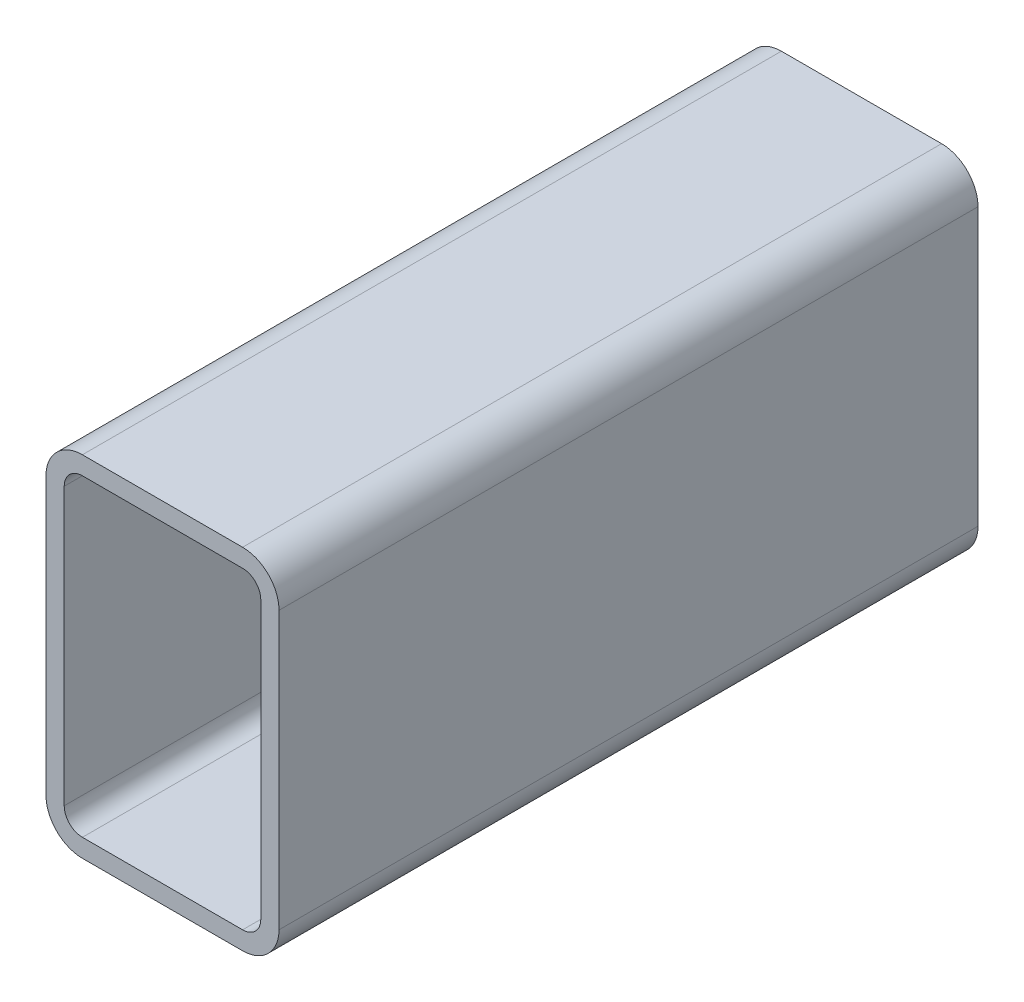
ISO-10303-21;
HEADER;
FILE_DESCRIPTION(('STEP AP214'),'2;1');
FILE_NAME('part.step','',(''),(''),'','','');
FILE_SCHEMA(('AUTOMOTIVE_DESIGN { 1 0 10303 214 1 1 1 1 }'));
ENDSEC;
DATA;
#1=APPLICATION_CONTEXT('core data for automotive mechanical design processes');
#2=APPLICATION_PROTOCOL_DEFINITION('international standard','automotive_design',2000,#1);
#3=PRODUCT_CONTEXT('',#1,'mechanical');
#4=PRODUCT('Part','Part','',(#3));
#5=PRODUCT_RELATED_PRODUCT_CATEGORY('part','',(#4));
#6=PRODUCT_DEFINITION_FORMATION('','',#4);
#7=PRODUCT_DEFINITION_CONTEXT('part definition',#1,'design');
#8=PRODUCT_DEFINITION('design','',#6,#7);
#9=PRODUCT_DEFINITION_SHAPE('','',#8);
#10=(LENGTH_UNIT() NAMED_UNIT(*) SI_UNIT(.MILLI.,.METRE.));
#11=(NAMED_UNIT(*) PLANE_ANGLE_UNIT() SI_UNIT($,.RADIAN.));
#12=(NAMED_UNIT(*) SI_UNIT($,.STERADIAN.) SOLID_ANGLE_UNIT());
#13=UNCERTAINTY_MEASURE_WITH_UNIT(LENGTH_MEASURE(1.E-05),#10,'distance_accuracy_value','');
#14=(GEOMETRIC_REPRESENTATION_CONTEXT(3) GLOBAL_UNCERTAINTY_ASSIGNED_CONTEXT((#13)) GLOBAL_UNIT_ASSIGNED_CONTEXT((#10,
#11,#12)) REPRESENTATION_CONTEXT('',''));
#15=CARTESIAN_POINT('',(0.,0.,0.));
#16=DIRECTION('',(0.,0.,1.));
#17=DIRECTION('',(1.,0.,0.));
#18=AXIS2_PLACEMENT_3D('',#15,#16,#17);
#19=CARTESIAN_POINT('',(17.5501778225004,138.536948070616,304.8));
#20=DIRECTION('',(0.,0.,1.));
#21=DIRECTION('',(1.,0.,0.));
#22=AXIS2_PLACEMENT_3D('',#19,#20,#21);
#23=PLANE('',#22);
#24=CARTESIAN_POINT('',(17.5501778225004,138.536948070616,304.8));
#25=DIRECTION('',(0.,0.,1.));
#26=DIRECTION('',(1.,0.,0.));
#27=AXIS2_PLACEMENT_3D('',#24,#25,#26);
#28=CIRCLE('',#27,15.875);
#29=CARTESIAN_POINT('',(17.5501778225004,154.411948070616,304.8));
#30=VERTEX_POINT('',#29);
#31=CARTESIAN_POINT('',(1.67517782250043,138.536948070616,304.8));
#32=VERTEX_POINT('',#31);
#33=EDGE_CURVE('E211',#30,#32,#28,.T.);
#34=ORIENTED_EDGE('',*,*,#33,.T.);
#35=DIRECTION('',(0.,-1.,0.));
#36=VECTOR('',#35,1.);
#37=CARTESIAN_POINT('',(1.67517782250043,17.8869480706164,304.8));
#38=LINE('',#37,#36);
#39=CARTESIAN_POINT('',(1.67517782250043,17.8869480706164,304.8));
#40=VERTEX_POINT('',#39);
#41=EDGE_CURVE('E214',#32,#40,#38,.T.);
#42=ORIENTED_EDGE('',*,*,#41,.T.);
#43=CARTESIAN_POINT('',(17.5501778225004,17.8869480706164,304.8));
#44=DIRECTION('',(0.,0.,1.));
#45=DIRECTION('',(1.,0.,0.));
#46=AXIS2_PLACEMENT_3D('',#43,#44,#45);
#47=CIRCLE('',#46,15.875);
#48=CARTESIAN_POINT('',(17.5501778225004,2.01194807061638,304.8));
#49=VERTEX_POINT('',#48);
#50=EDGE_CURVE('E217',#40,#49,#47,.T.);
#51=ORIENTED_EDGE('',*,*,#50,.T.);
#52=DIRECTION('',(1.,0.,0.));
#53=VECTOR('',#52,1.);
#54=CARTESIAN_POINT('',(87.4001778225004,2.01194807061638,304.8));
#55=LINE('',#54,#53);
#56=CARTESIAN_POINT('',(87.4001778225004,2.01194807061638,304.8));
#57=VERTEX_POINT('',#56);
#58=EDGE_CURVE('E219',#49,#57,#55,.T.);
#59=ORIENTED_EDGE('',*,*,#58,.T.);
#60=CARTESIAN_POINT('',(87.4001778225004,17.8869480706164,304.8));
#61=DIRECTION('',(0.,0.,1.));
#62=DIRECTION('',(1.,0.,0.));
#63=AXIS2_PLACEMENT_3D('',#60,#61,#62);
#64=CIRCLE('',#63,15.875);
#65=CARTESIAN_POINT('',(103.2751778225,17.8869480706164,304.8));
#66=VERTEX_POINT('',#65);
#67=EDGE_CURVE('E221',#57,#66,#64,.T.);
#68=ORIENTED_EDGE('',*,*,#67,.T.);
#69=DIRECTION('',(0.,1.,0.));
#70=VECTOR('',#69,1.);
#71=CARTESIAN_POINT('',(103.2751778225,138.536948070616,304.8));
#72=LINE('',#71,#70);
#73=CARTESIAN_POINT('',(103.2751778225,138.536948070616,304.8));
#74=VERTEX_POINT('',#73);
#75=EDGE_CURVE('E223',#66,#74,#72,.T.);
#76=ORIENTED_EDGE('',*,*,#75,.T.);
#77=CARTESIAN_POINT('',(87.4001778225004,138.536948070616,304.8));
#78=DIRECTION('',(0.,0.,1.));
#79=DIRECTION('',(1.,0.,0.));
#80=AXIS2_PLACEMENT_3D('',#77,#78,#79);
#81=CIRCLE('',#80,15.875);
#82=CARTESIAN_POINT('',(87.4001778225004,154.411948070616,304.8));
#83=VERTEX_POINT('',#82);
#84=EDGE_CURVE('E225',#74,#83,#81,.T.);
#85=ORIENTED_EDGE('',*,*,#84,.T.);
#86=DIRECTION('',(-1.,0.,0.));
#87=VECTOR('',#86,1.);
#88=CARTESIAN_POINT('',(17.5501778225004,154.411948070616,304.8));
#89=LINE('',#88,#87);
#90=EDGE_CURVE('E227',#83,#30,#89,.T.);
#91=ORIENTED_EDGE('',*,*,#90,.T.);
#92=EDGE_LOOP('',(#34,#42,#51,#59,#68,#76,#85,#91));
#93=FACE_BOUND('',#92,.T.);
#94=DIRECTION('',(0.,-1.,0.));
#95=VECTOR('',#94,1.);
#96=CARTESIAN_POINT('',(9.61267782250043,17.8869480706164,304.8));
#97=LINE('',#96,#95);
#98=CARTESIAN_POINT('',(9.61267782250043,138.536948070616,304.8));
#99=VERTEX_POINT('',#98);
#100=CARTESIAN_POINT('',(9.61267782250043,17.8869480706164,304.8));
#101=VERTEX_POINT('',#100);
#102=EDGE_CURVE('E154',#99,#101,#97,.T.);
#103=ORIENTED_EDGE('',*,*,#102,.F.);
#104=CARTESIAN_POINT('',(17.5501778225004,138.536948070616,304.8));
#105=DIRECTION('',(0.,0.,1.));
#106=DIRECTION('',(1.,0.,0.));
#107=AXIS2_PLACEMENT_3D('',#104,#105,#106);
#108=CIRCLE('',#107,7.93750000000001);
#109=CARTESIAN_POINT('',(17.5501778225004,146.474448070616,304.8));
#110=VERTEX_POINT('',#109);
#111=EDGE_CURVE('E146',#110,#99,#108,.T.);
#112=ORIENTED_EDGE('',*,*,#111,.F.);
#113=DIRECTION('',(-1.,0.,0.));
#114=VECTOR('',#113,1.);
#115=CARTESIAN_POINT('',(17.5501778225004,146.474448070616,304.8));
#116=LINE('',#115,#114);
#117=CARTESIAN_POINT('',(87.4001778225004,146.474448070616,304.8));
#118=VERTEX_POINT('',#117);
#119=EDGE_CURVE('E179',#118,#110,#116,.T.);
#120=ORIENTED_EDGE('',*,*,#119,.F.);
#121=CARTESIAN_POINT('',(87.4001778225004,138.536948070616,304.8));
#122=DIRECTION('',(0.,0.,1.));
#123=DIRECTION('',(1.,0.,0.));
#124=AXIS2_PLACEMENT_3D('',#121,#122,#123);
#125=CIRCLE('',#124,7.93750000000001);
#126=CARTESIAN_POINT('',(95.3376778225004,138.536948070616,304.8));
#127=VERTEX_POINT('',#126);
#128=EDGE_CURVE('E177',#127,#118,#125,.T.);
#129=ORIENTED_EDGE('',*,*,#128,.F.);
#130=DIRECTION('',(0.,1.,0.));
#131=VECTOR('',#130,1.);
#132=CARTESIAN_POINT('',(95.3376778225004,138.536948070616,304.8));
#133=LINE('',#132,#131);
#134=CARTESIAN_POINT('',(95.3376778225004,17.8869480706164,304.8));
#135=VERTEX_POINT('',#134);
#136=EDGE_CURVE('E175',#135,#127,#133,.T.);
#137=ORIENTED_EDGE('',*,*,#136,.F.);
#138=CARTESIAN_POINT('',(87.4001778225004,17.8869480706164,304.8));
#139=DIRECTION('',(0.,0.,1.));
#140=DIRECTION('',(1.,0.,0.));
#141=AXIS2_PLACEMENT_3D('',#138,#139,#140);
#142=CIRCLE('',#141,7.9375);
#143=CARTESIAN_POINT('',(87.4001778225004,9.94944807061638,304.8));
#144=VERTEX_POINT('',#143);
#145=EDGE_CURVE('E173',#144,#135,#142,.T.);
#146=ORIENTED_EDGE('',*,*,#145,.F.);
#147=DIRECTION('',(1.,0.,0.));
#148=VECTOR('',#147,1.);
#149=CARTESIAN_POINT('',(87.4001778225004,9.94944807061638,304.8));
#150=LINE('',#149,#148);
#151=CARTESIAN_POINT('',(17.5501778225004,9.94944807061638,304.8));
#152=VERTEX_POINT('',#151);
#153=EDGE_CURVE('E169',#152,#144,#150,.T.);
#154=ORIENTED_EDGE('',*,*,#153,.F.);
#155=CARTESIAN_POINT('',(17.5501778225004,17.8869480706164,304.8));
#156=DIRECTION('',(0.,0.,1.));
#157=DIRECTION('',(1.,0.,0.));
#158=AXIS2_PLACEMENT_3D('',#155,#156,#157);
#159=CIRCLE('',#158,7.9375);
#160=EDGE_CURVE('E167',#101,#152,#159,.T.);
#161=ORIENTED_EDGE('',*,*,#160,.F.);
#162=EDGE_LOOP('',(#103,#112,#120,#129,#137,#146,#154,#161));
#163=FACE_BOUND('',#162,.T.);
#164=ADVANCED_FACE('F33',(#93,#163),#23,.T.);
#165=CARTESIAN_POINT('',(17.5501778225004,138.536948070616,0.));
#166=DIRECTION('',(0.,0.,1.));
#167=DIRECTION('',(1.,0.,0.));
#168=AXIS2_PLACEMENT_3D('',#165,#166,#167);
#169=PLANE('',#168);
#170=CARTESIAN_POINT('',(17.5501778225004,138.536948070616,0.));
#171=DIRECTION('',(0.,0.,1.));
#172=DIRECTION('',(1.,0.,0.));
#173=AXIS2_PLACEMENT_3D('',#170,#171,#172);
#174=CIRCLE('',#173,15.875);
#175=CARTESIAN_POINT('',(17.5501778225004,154.411948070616,0.));
#176=VERTEX_POINT('',#175);
#177=CARTESIAN_POINT('',(1.67517782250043,138.536948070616,0.));
#178=VERTEX_POINT('',#177);
#179=EDGE_CURVE('E162',#176,#178,#174,.T.);
#180=ORIENTED_EDGE('',*,*,#179,.F.);
#181=DIRECTION('',(-1.,0.,0.));
#182=VECTOR('',#181,1.);
#183=CARTESIAN_POINT('',(17.5501778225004,154.411948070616,0.));
#184=LINE('',#183,#182);
#185=CARTESIAN_POINT('',(87.4001778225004,154.411948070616,0.));
#186=VERTEX_POINT('',#185);
#187=EDGE_CURVE('E215',#186,#176,#184,.T.);
#188=ORIENTED_EDGE('',*,*,#187,.F.);
#189=CARTESIAN_POINT('',(87.4001778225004,138.536948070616,0.));
#190=DIRECTION('',(0.,0.,1.));
#191=DIRECTION('',(1.,0.,0.));
#192=AXIS2_PLACEMENT_3D('',#189,#190,#191);
#193=CIRCLE('',#192,15.875);
#194=CARTESIAN_POINT('',(103.2751778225,138.536948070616,0.));
#195=VERTEX_POINT('',#194);
#196=EDGE_CURVE('E242',#195,#186,#193,.T.);
#197=ORIENTED_EDGE('',*,*,#196,.F.);
#198=DIRECTION('',(0.,1.,0.));
#199=VECTOR('',#198,1.);
#200=CARTESIAN_POINT('',(103.2751778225,138.536948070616,0.));
#201=LINE('',#200,#199);
#202=CARTESIAN_POINT('',(103.2751778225,17.8869480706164,0.));
#203=VERTEX_POINT('',#202);
#204=EDGE_CURVE('E240',#203,#195,#201,.T.);
#205=ORIENTED_EDGE('',*,*,#204,.F.);
#206=CARTESIAN_POINT('',(87.4001778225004,17.8869480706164,0.));
#207=DIRECTION('',(0.,0.,1.));
#208=DIRECTION('',(1.,0.,0.));
#209=AXIS2_PLACEMENT_3D('',#206,#207,#208);
#210=CIRCLE('',#209,15.875);
#211=CARTESIAN_POINT('',(87.4001778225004,2.01194807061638,0.));
#212=VERTEX_POINT('',#211);
#213=EDGE_CURVE('E238',#212,#203,#210,.T.);
#214=ORIENTED_EDGE('',*,*,#213,.F.);
#215=DIRECTION('',(1.,0.,0.));
#216=VECTOR('',#215,1.);
#217=CARTESIAN_POINT('',(87.4001778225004,2.01194807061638,0.));
#218=LINE('',#217,#216);
#219=CARTESIAN_POINT('',(17.5501778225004,2.01194807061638,0.));
#220=VERTEX_POINT('',#219);
#221=EDGE_CURVE('E236',#220,#212,#218,.T.);
#222=ORIENTED_EDGE('',*,*,#221,.F.);
#223=CARTESIAN_POINT('',(17.5501778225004,17.8869480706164,0.));
#224=DIRECTION('',(0.,0.,1.));
#225=DIRECTION('',(1.,0.,0.));
#226=AXIS2_PLACEMENT_3D('',#223,#224,#225);
#227=CIRCLE('',#226,15.875);
#228=CARTESIAN_POINT('',(1.67517782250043,17.8869480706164,0.));
#229=VERTEX_POINT('',#228);
#230=EDGE_CURVE('E234',#229,#220,#227,.T.);
#231=ORIENTED_EDGE('',*,*,#230,.F.);
#232=DIRECTION('',(0.,-1.,0.));
#233=VECTOR('',#232,1.);
#234=CARTESIAN_POINT('',(1.67517782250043,17.8869480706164,0.));
#235=LINE('',#234,#233);
#236=EDGE_CURVE('E232',#178,#229,#235,.T.);
#237=ORIENTED_EDGE('',*,*,#236,.F.);
#238=EDGE_LOOP('',(#180,#188,#197,#205,#214,#222,#231,#237));
#239=FACE_BOUND('',#238,.T.);
#240=CARTESIAN_POINT('',(17.5501778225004,138.536948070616,0.));
#241=DIRECTION('',(0.,0.,1.));
#242=DIRECTION('',(1.,0.,0.));
#243=AXIS2_PLACEMENT_3D('',#240,#241,#242);
#244=CIRCLE('',#243,7.93750000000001);
#245=CARTESIAN_POINT('',(17.5501778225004,146.474448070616,0.));
#246=VERTEX_POINT('',#245);
#247=CARTESIAN_POINT('',(9.61267782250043,138.536948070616,0.));
#248=VERTEX_POINT('',#247);
#249=EDGE_CURVE('E56',#246,#248,#244,.T.);
#250=ORIENTED_EDGE('',*,*,#249,.T.);
#251=DIRECTION('',(0.,-1.,0.));
#252=VECTOR('',#251,1.);
#253=CARTESIAN_POINT('',(9.61267782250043,17.8869480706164,0.));
#254=LINE('',#253,#252);
#255=CARTESIAN_POINT('',(9.61267782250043,17.8869480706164,0.));
#256=VERTEX_POINT('',#255);
#257=EDGE_CURVE('E161',#248,#256,#254,.T.);
#258=ORIENTED_EDGE('',*,*,#257,.T.);
#259=CARTESIAN_POINT('',(17.5501778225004,17.8869480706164,0.));
#260=DIRECTION('',(0.,0.,1.));
#261=DIRECTION('',(1.,0.,0.));
#262=AXIS2_PLACEMENT_3D('',#259,#260,#261);
#263=CIRCLE('',#262,7.9375);
#264=CARTESIAN_POINT('',(17.5501778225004,9.94944807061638,0.));
#265=VERTEX_POINT('',#264);
#266=EDGE_CURVE('E183',#256,#265,#263,.T.);
#267=ORIENTED_EDGE('',*,*,#266,.T.);
#268=DIRECTION('',(1.,0.,0.));
#269=VECTOR('',#268,1.);
#270=CARTESIAN_POINT('',(87.4001778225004,9.94944807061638,0.));
#271=LINE('',#270,#269);
#272=CARTESIAN_POINT('',(87.4001778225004,9.94944807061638,0.));
#273=VERTEX_POINT('',#272);
#274=EDGE_CURVE('E186',#265,#273,#271,.T.);
#275=ORIENTED_EDGE('',*,*,#274,.T.);
#276=CARTESIAN_POINT('',(87.4001778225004,17.8869480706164,0.));
#277=DIRECTION('',(0.,0.,1.));
#278=DIRECTION('',(1.,0.,0.));
#279=AXIS2_PLACEMENT_3D('',#276,#277,#278);
#280=CIRCLE('',#279,7.9375);
#281=CARTESIAN_POINT('',(95.3376778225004,17.8869480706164,0.));
#282=VERTEX_POINT('',#281);
#283=EDGE_CURVE('E189',#273,#282,#280,.T.);
#284=ORIENTED_EDGE('',*,*,#283,.T.);
#285=DIRECTION('',(0.,1.,0.));
#286=VECTOR('',#285,1.);
#287=CARTESIAN_POINT('',(95.3376778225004,138.536948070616,0.));
#288=LINE('',#287,#286);
#289=CARTESIAN_POINT('',(95.3376778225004,138.536948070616,0.));
#290=VERTEX_POINT('',#289);
#291=EDGE_CURVE('E192',#282,#290,#288,.T.);
#292=ORIENTED_EDGE('',*,*,#291,.T.);
#293=CARTESIAN_POINT('',(87.4001778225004,138.536948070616,0.));
#294=DIRECTION('',(0.,0.,1.));
#295=DIRECTION('',(1.,0.,0.));
#296=AXIS2_PLACEMENT_3D('',#293,#294,#295);
#297=CIRCLE('',#296,7.93750000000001);
#298=CARTESIAN_POINT('',(87.4001778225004,146.474448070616,0.));
#299=VERTEX_POINT('',#298);
#300=EDGE_CURVE('E195',#290,#299,#297,.T.);
#301=ORIENTED_EDGE('',*,*,#300,.T.);
#302=DIRECTION('',(-1.,0.,0.));
#303=VECTOR('',#302,1.);
#304=CARTESIAN_POINT('',(17.5501778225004,146.474448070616,0.));
#305=LINE('',#304,#303);
#306=EDGE_CURVE('E155',#299,#246,#305,.T.);
#307=ORIENTED_EDGE('',*,*,#306,.T.);
#308=EDGE_LOOP('',(#250,#258,#267,#275,#284,#292,#301,#307));
#309=FACE_BOUND('',#308,.T.);
#310=ADVANCED_FACE('F272',(#239,#309),#169,.F.);
#311=CARTESIAN_POINT('',(17.5501778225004,138.536948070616,304.8));
#312=DIRECTION('',(0.,0.,-1.));
#313=DIRECTION('',(-1.,0.,0.));
#314=AXIS2_PLACEMENT_3D('',#311,#312,#313);
#315=CYLINDRICAL_SURFACE('',#314,15.875);
#316=ORIENTED_EDGE('',*,*,#179,.T.);
#317=DIRECTION('',(0.,0.,-1.));
#318=VECTOR('',#317,1.);
#319=CARTESIAN_POINT('',(1.67517782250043,138.536948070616,304.8));
#320=LINE('',#319,#318);
#321=EDGE_CURVE('E11',#32,#178,#320,.T.);
#322=ORIENTED_EDGE('',*,*,#321,.F.);
#323=ORIENTED_EDGE('',*,*,#33,.F.);
#324=DIRECTION('',(0.,0.,-1.));
#325=VECTOR('',#324,1.);
#326=CARTESIAN_POINT('',(17.5501778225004,154.411948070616,304.8));
#327=LINE('',#326,#325);
#328=EDGE_CURVE('E229',#30,#176,#327,.T.);
#329=ORIENTED_EDGE('',*,*,#328,.T.);
#330=EDGE_LOOP('',(#316,#322,#323,#329));
#331=FACE_BOUND('',#330,.T.);
#332=ADVANCED_FACE('F35',(#331),#315,.T.);
#333=CARTESIAN_POINT('',(1.67517782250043,17.8869480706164,304.8));
#334=DIRECTION('',(1.,0.,0.));
#335=DIRECTION('',(0.,0.,-1.));
#336=AXIS2_PLACEMENT_3D('',#333,#334,#335);
#337=PLANE('',#336);
#338=ORIENTED_EDGE('',*,*,#236,.T.);
#339=DIRECTION('',(0.,0.,-1.));
#340=VECTOR('',#339,1.);
#341=CARTESIAN_POINT('',(1.67517782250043,17.8869480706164,304.8));
#342=LINE('',#341,#340);
#343=EDGE_CURVE('E41',#40,#229,#342,.T.);
#344=ORIENTED_EDGE('',*,*,#343,.F.);
#345=ORIENTED_EDGE('',*,*,#41,.F.);
#346=ORIENTED_EDGE('',*,*,#321,.T.);
#347=EDGE_LOOP('',(#338,#344,#345,#346));
#348=FACE_BOUND('',#347,.T.);
#349=ADVANCED_FACE('F289',(#348),#337,.F.);
#350=CARTESIAN_POINT('',(17.5501778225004,17.8869480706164,304.8));
#351=DIRECTION('',(0.,0.,-1.));
#352=DIRECTION('',(-1.,0.,0.));
#353=AXIS2_PLACEMENT_3D('',#350,#351,#352);
#354=CYLINDRICAL_SURFACE('',#353,15.875);
#355=ORIENTED_EDGE('',*,*,#230,.T.);
#356=DIRECTION('',(0.,0.,-1.));
#357=VECTOR('',#356,1.);
#358=CARTESIAN_POINT('',(17.5501778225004,2.01194807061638,304.8));
#359=LINE('',#358,#357);
#360=EDGE_CURVE('E259',#49,#220,#359,.T.);
#361=ORIENTED_EDGE('',*,*,#360,.F.);
#362=ORIENTED_EDGE('',*,*,#50,.F.);
#363=ORIENTED_EDGE('',*,*,#343,.T.);
#364=EDGE_LOOP('',(#355,#361,#362,#363));
#365=FACE_BOUND('',#364,.T.);
#366=ADVANCED_FACE('F266',(#365),#354,.T.);
#367=CARTESIAN_POINT('',(87.4001778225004,2.01194807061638,304.8));
#368=DIRECTION('',(0.,1.,0.));
#369=DIRECTION('',(0.,0.,1.));
#370=AXIS2_PLACEMENT_3D('',#367,#368,#369);
#371=PLANE('',#370);
#372=ORIENTED_EDGE('',*,*,#221,.T.);
#373=DIRECTION('',(0.,0.,-1.));
#374=VECTOR('',#373,1.);
#375=CARTESIAN_POINT('',(87.4001778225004,2.01194807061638,304.8));
#376=LINE('',#375,#374);
#377=EDGE_CURVE('E256',#57,#212,#376,.T.);
#378=ORIENTED_EDGE('',*,*,#377,.F.);
#379=ORIENTED_EDGE('',*,*,#58,.F.);
#380=ORIENTED_EDGE('',*,*,#360,.T.);
#381=EDGE_LOOP('',(#372,#378,#379,#380));
#382=FACE_BOUND('',#381,.T.);
#383=ADVANCED_FACE('F278',(#382),#371,.F.);
#384=CARTESIAN_POINT('',(87.4001778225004,17.8869480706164,304.8));
#385=DIRECTION('',(0.,0.,-1.));
#386=DIRECTION('',(-1.,0.,0.));
#387=AXIS2_PLACEMENT_3D('',#384,#385,#386);
#388=CYLINDRICAL_SURFACE('',#387,15.875);
#389=ORIENTED_EDGE('',*,*,#213,.T.);
#390=DIRECTION('',(0.,0.,-1.));
#391=VECTOR('',#390,1.);
#392=CARTESIAN_POINT('',(103.2751778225,17.8869480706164,304.8));
#393=LINE('',#392,#391);
#394=EDGE_CURVE('E253',#66,#203,#393,.T.);
#395=ORIENTED_EDGE('',*,*,#394,.F.);
#396=ORIENTED_EDGE('',*,*,#67,.F.);
#397=ORIENTED_EDGE('',*,*,#377,.T.);
#398=EDGE_LOOP('',(#389,#395,#396,#397));
#399=FACE_BOUND('',#398,.T.);
#400=ADVANCED_FACE('F282',(#399),#388,.T.);
#401=CARTESIAN_POINT('',(103.2751778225,138.536948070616,304.8));
#402=DIRECTION('',(-1.,0.,0.));
#403=DIRECTION('',(0.,0.,1.));
#404=AXIS2_PLACEMENT_3D('',#401,#402,#403);
#405=PLANE('',#404);
#406=ORIENTED_EDGE('',*,*,#204,.T.);
#407=DIRECTION('',(0.,0.,-1.));
#408=VECTOR('',#407,1.);
#409=CARTESIAN_POINT('',(103.2751778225,138.536948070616,304.8));
#410=LINE('',#409,#408);
#411=EDGE_CURVE('E250',#74,#195,#410,.T.);
#412=ORIENTED_EDGE('',*,*,#411,.F.);
#413=ORIENTED_EDGE('',*,*,#75,.F.);
#414=ORIENTED_EDGE('',*,*,#394,.T.);
#415=EDGE_LOOP('',(#406,#412,#413,#414));
#416=FACE_BOUND('',#415,.T.);
#417=ADVANCED_FACE('F302',(#416),#405,.F.);
#418=CARTESIAN_POINT('',(87.4001778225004,138.536948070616,304.8));
#419=DIRECTION('',(0.,0.,-1.));
#420=DIRECTION('',(-1.,0.,0.));
#421=AXIS2_PLACEMENT_3D('',#418,#419,#420);
#422=CYLINDRICAL_SURFACE('',#421,15.875);
#423=ORIENTED_EDGE('',*,*,#196,.T.);
#424=DIRECTION('',(0.,0.,-1.));
#425=VECTOR('',#424,1.);
#426=CARTESIAN_POINT('',(87.4001778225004,154.411948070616,304.8));
#427=LINE('',#426,#425);
#428=EDGE_CURVE('E247',#83,#186,#427,.T.);
#429=ORIENTED_EDGE('',*,*,#428,.F.);
#430=ORIENTED_EDGE('',*,*,#84,.F.);
#431=ORIENTED_EDGE('',*,*,#411,.T.);
#432=EDGE_LOOP('',(#423,#429,#430,#431));
#433=FACE_BOUND('',#432,.T.);
#434=ADVANCED_FACE('F300',(#433),#422,.T.);
#435=CARTESIAN_POINT('',(17.5501778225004,154.411948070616,304.8));
#436=DIRECTION('',(0.,-1.,0.));
#437=DIRECTION('',(0.,0.,-1.));
#438=AXIS2_PLACEMENT_3D('',#435,#436,#437);
#439=PLANE('',#438);
#440=ORIENTED_EDGE('',*,*,#187,.T.);
#441=ORIENTED_EDGE('',*,*,#328,.F.);
#442=ORIENTED_EDGE('',*,*,#90,.F.);
#443=ORIENTED_EDGE('',*,*,#428,.T.);
#444=EDGE_LOOP('',(#440,#441,#442,#443));
#445=FACE_BOUND('',#444,.T.);
#446=ADVANCED_FACE('F295',(#445),#439,.F.);
#447=CARTESIAN_POINT('',(17.5501778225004,138.536948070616,304.8));
#448=DIRECTION('',(0.,0.,-1.));
#449=DIRECTION('',(-1.,0.,0.));
#450=AXIS2_PLACEMENT_3D('',#447,#448,#449);
#451=CYLINDRICAL_SURFACE('',#450,7.93750000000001);
#452=ORIENTED_EDGE('',*,*,#249,.F.);
#453=DIRECTION('',(0.,0.,-1.));
#454=VECTOR('',#453,1.);
#455=CARTESIAN_POINT('',(17.5501778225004,146.474448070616,304.8));
#456=LINE('',#455,#454);
#457=EDGE_CURVE('E150',#110,#246,#456,.T.);
#458=ORIENTED_EDGE('',*,*,#457,.F.);
#459=ORIENTED_EDGE('',*,*,#111,.T.);
#460=DIRECTION('',(0.,0.,-1.));
#461=VECTOR('',#460,1.);
#462=CARTESIAN_POINT('',(9.61267782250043,138.536948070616,304.8));
#463=LINE('',#462,#461);
#464=EDGE_CURVE('E149',#99,#248,#463,.T.);
#465=ORIENTED_EDGE('',*,*,#464,.T.);
#466=EDGE_LOOP('',(#452,#458,#459,#465));
#467=FACE_BOUND('',#466,.T.);
#468=ADVANCED_FACE('F148',(#467),#451,.F.);
#469=CARTESIAN_POINT('',(9.61267782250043,17.8869480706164,304.8));
#470=DIRECTION('',(1.,0.,0.));
#471=DIRECTION('',(0.,0.,-1.));
#472=AXIS2_PLACEMENT_3D('',#469,#470,#471);
#473=PLANE('',#472);
#474=ORIENTED_EDGE('',*,*,#257,.F.);
#475=ORIENTED_EDGE('',*,*,#464,.F.);
#476=ORIENTED_EDGE('',*,*,#102,.T.);
#477=DIRECTION('',(0.,0.,-1.));
#478=VECTOR('',#477,1.);
#479=CARTESIAN_POINT('',(9.61267782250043,17.8869480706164,304.8));
#480=LINE('',#479,#478);
#481=EDGE_CURVE('E163',#101,#256,#480,.T.);
#482=ORIENTED_EDGE('',*,*,#481,.T.);
#483=EDGE_LOOP('',(#474,#475,#476,#482));
#484=FACE_BOUND('',#483,.T.);
#485=ADVANCED_FACE('F158',(#484),#473,.T.);
#486=CARTESIAN_POINT('',(17.5501778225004,17.8869480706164,304.8));
#487=DIRECTION('',(0.,0.,-1.));
#488=DIRECTION('',(-1.,0.,0.));
#489=AXIS2_PLACEMENT_3D('',#486,#487,#488);
#490=CYLINDRICAL_SURFACE('',#489,7.9375);
#491=ORIENTED_EDGE('',*,*,#266,.F.);
#492=ORIENTED_EDGE('',*,*,#481,.F.);
#493=ORIENTED_EDGE('',*,*,#160,.T.);
#494=DIRECTION('',(0.,0.,-1.));
#495=VECTOR('',#494,1.);
#496=CARTESIAN_POINT('',(17.5501778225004,9.94944807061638,304.8));
#497=LINE('',#496,#495);
#498=EDGE_CURVE('E208',#152,#265,#497,.T.);
#499=ORIENTED_EDGE('',*,*,#498,.T.);
#500=EDGE_LOOP('',(#491,#492,#493,#499));
#501=FACE_BOUND('',#500,.T.);
#502=ADVANCED_FACE('F327',(#501),#490,.F.);
#503=CARTESIAN_POINT('',(87.4001778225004,9.94944807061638,304.8));
#504=DIRECTION('',(0.,1.,0.));
#505=DIRECTION('',(0.,0.,1.));
#506=AXIS2_PLACEMENT_3D('',#503,#504,#505);
#507=PLANE('',#506);
#508=ORIENTED_EDGE('',*,*,#274,.F.);
#509=ORIENTED_EDGE('',*,*,#498,.F.);
#510=ORIENTED_EDGE('',*,*,#153,.T.);
#511=DIRECTION('',(0.,0.,-1.));
#512=VECTOR('',#511,1.);
#513=CARTESIAN_POINT('',(87.4001778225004,9.94944807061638,304.8));
#514=LINE('',#513,#512);
#515=EDGE_CURVE('E206',#144,#273,#514,.T.);
#516=ORIENTED_EDGE('',*,*,#515,.T.);
#517=EDGE_LOOP('',(#508,#509,#510,#516));
#518=FACE_BOUND('',#517,.T.);
#519=ADVANCED_FACE('F331',(#518),#507,.T.);
#520=CARTESIAN_POINT('',(87.4001778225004,17.8869480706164,304.8));
#521=DIRECTION('',(0.,0.,-1.));
#522=DIRECTION('',(-1.,0.,0.));
#523=AXIS2_PLACEMENT_3D('',#520,#521,#522);
#524=CYLINDRICAL_SURFACE('',#523,7.9375);
#525=ORIENTED_EDGE('',*,*,#283,.F.);
#526=ORIENTED_EDGE('',*,*,#515,.F.);
#527=ORIENTED_EDGE('',*,*,#145,.T.);
#528=DIRECTION('',(0.,0.,-1.));
#529=VECTOR('',#528,1.);
#530=CARTESIAN_POINT('',(95.3376778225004,17.8869480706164,304.8));
#531=LINE('',#530,#529);
#532=EDGE_CURVE('E204',#135,#282,#531,.T.);
#533=ORIENTED_EDGE('',*,*,#532,.T.);
#534=EDGE_LOOP('',(#525,#526,#527,#533));
#535=FACE_BOUND('',#534,.T.);
#536=ADVANCED_FACE('F337',(#535),#524,.F.);
#537=CARTESIAN_POINT('',(95.3376778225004,138.536948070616,304.8));
#538=DIRECTION('',(-1.,0.,0.));
#539=DIRECTION('',(0.,0.,1.));
#540=AXIS2_PLACEMENT_3D('',#537,#538,#539);
#541=PLANE('',#540);
#542=ORIENTED_EDGE('',*,*,#291,.F.);
#543=ORIENTED_EDGE('',*,*,#532,.F.);
#544=ORIENTED_EDGE('',*,*,#136,.T.);
#545=DIRECTION('',(0.,0.,-1.));
#546=VECTOR('',#545,1.);
#547=CARTESIAN_POINT('',(95.3376778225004,138.536948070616,304.8));
#548=LINE('',#547,#546);
#549=EDGE_CURVE('E202',#127,#290,#548,.T.);
#550=ORIENTED_EDGE('',*,*,#549,.T.);
#551=EDGE_LOOP('',(#542,#543,#544,#550));
#552=FACE_BOUND('',#551,.T.);
#553=ADVANCED_FACE('F341',(#552),#541,.T.);
#554=CARTESIAN_POINT('',(87.4001778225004,138.536948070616,304.8));
#555=DIRECTION('',(0.,0.,-1.));
#556=DIRECTION('',(-1.,0.,0.));
#557=AXIS2_PLACEMENT_3D('',#554,#555,#556);
#558=CYLINDRICAL_SURFACE('',#557,7.93750000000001);
#559=ORIENTED_EDGE('',*,*,#300,.F.);
#560=ORIENTED_EDGE('',*,*,#549,.F.);
#561=ORIENTED_EDGE('',*,*,#128,.T.);
#562=DIRECTION('',(0.,0.,-1.));
#563=VECTOR('',#562,1.);
#564=CARTESIAN_POINT('',(87.4001778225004,146.474448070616,304.8));
#565=LINE('',#564,#563);
#566=EDGE_CURVE('E48',#118,#299,#565,.T.);
#567=ORIENTED_EDGE('',*,*,#566,.T.);
#568=EDGE_LOOP('',(#559,#560,#561,#567));
#569=FACE_BOUND('',#568,.T.);
#570=ADVANCED_FACE('F345',(#569),#558,.F.);
#571=CARTESIAN_POINT('',(17.5501778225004,146.474448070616,304.8));
#572=DIRECTION('',(0.,-1.,0.));
#573=DIRECTION('',(0.,0.,-1.));
#574=AXIS2_PLACEMENT_3D('',#571,#572,#573);
#575=PLANE('',#574);
#576=ORIENTED_EDGE('',*,*,#306,.F.);
#577=ORIENTED_EDGE('',*,*,#566,.F.);
#578=ORIENTED_EDGE('',*,*,#119,.T.);
#579=ORIENTED_EDGE('',*,*,#457,.T.);
#580=EDGE_LOOP('',(#576,#577,#578,#579));
#581=FACE_BOUND('',#580,.T.);
#582=ADVANCED_FACE('F349',(#581),#575,.T.);
#583=CLOSED_SHELL('',(#164,#310,#332,#349,#366,#383,#400,#417,#434,#446,#468,#485,#502,#519,
#536,#553,#570,#582));
#584=MANIFOLD_SOLID_BREP('B2',#583);
#585=ADVANCED_BREP_SHAPE_REPRESENTATION('',(#18,#584),#14);
#586=SHAPE_DEFINITION_REPRESENTATION(#9,#585);
ENDSEC;
END-ISO-10303-21;
